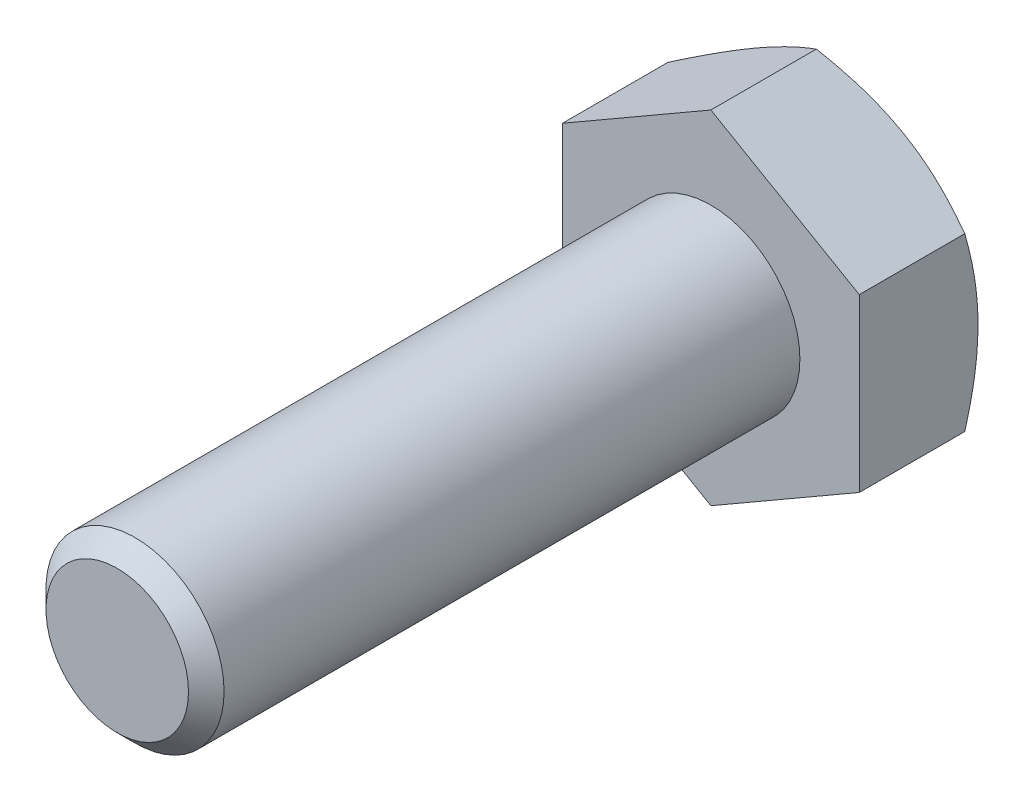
ISO-10303-21;
HEADER;
FILE_DESCRIPTION(('STEP AP214'),'2;1');
FILE_NAME('part.step','',(''),(''),'','','');
FILE_SCHEMA(('AUTOMOTIVE_DESIGN { 1 0 10303 214 1 1 1 1 }'));
ENDSEC;
DATA;
#1=APPLICATION_CONTEXT('core data for automotive mechanical design processes');
#2=APPLICATION_PROTOCOL_DEFINITION('international standard','automotive_design',2000,#1);
#3=PRODUCT_CONTEXT('',#1,'mechanical');
#4=PRODUCT('Part','Part','',(#3));
#5=PRODUCT_RELATED_PRODUCT_CATEGORY('part','',(#4));
#6=PRODUCT_DEFINITION_FORMATION('','',#4);
#7=PRODUCT_DEFINITION_CONTEXT('part definition',#1,'design');
#8=PRODUCT_DEFINITION('design','',#6,#7);
#9=PRODUCT_DEFINITION_SHAPE('','',#8);
#10=(LENGTH_UNIT() NAMED_UNIT(*) SI_UNIT(.MILLI.,.METRE.));
#11=(NAMED_UNIT(*) PLANE_ANGLE_UNIT() SI_UNIT($,.RADIAN.));
#12=(NAMED_UNIT(*) SI_UNIT($,.STERADIAN.) SOLID_ANGLE_UNIT());
#13=UNCERTAINTY_MEASURE_WITH_UNIT(LENGTH_MEASURE(1.E-05),#10,'distance_accuracy_value','');
#14=(GEOMETRIC_REPRESENTATION_CONTEXT(3) GLOBAL_UNCERTAINTY_ASSIGNED_CONTEXT((#13)) GLOBAL_UNIT_ASSIGNED_CONTEXT((#10,
#11,#12)) REPRESENTATION_CONTEXT('',''));
#15=CARTESIAN_POINT('',(0.,0.,0.));
#16=DIRECTION('',(0.,0.,1.));
#17=DIRECTION('',(1.,0.,0.));
#18=AXIS2_PLACEMENT_3D('',#15,#16,#17);
#19=CARTESIAN_POINT('',(0.,0.,20.));
#20=DIRECTION('',(0.,0.,1.));
#21=DIRECTION('',(1.,0.,0.));
#22=AXIS2_PLACEMENT_3D('',#19,#20,#21);
#23=PLANE('',#22);
#24=CARTESIAN_POINT('',(0.,0.,20.));
#25=DIRECTION('',(0.,0.,1.));
#26=DIRECTION('',(1.,0.,0.));
#27=AXIS2_PLACEMENT_3D('',#24,#25,#26);
#28=CIRCLE('',#27,2.4);
#29=CARTESIAN_POINT('',(2.40000000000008,0.,20.));
#30=VERTEX_POINT('',#29);
#31=EDGE_CURVE('E203',#30,#30,#28,.T.);
#32=ORIENTED_EDGE('',*,*,#31,.T.);
#33=EDGE_LOOP('',(#32));
#34=FACE_BOUND('',#33,.T.);
#35=ADVANCED_FACE('F29',(#34),#23,.T.);
#36=CARTESIAN_POINT('',(0.,0.,0.));
#37=DIRECTION('',(0.,0.,1.));
#38=DIRECTION('',(1.,0.,0.));
#39=AXIS2_PLACEMENT_3D('',#36,#37,#38);
#40=CYLINDRICAL_SURFACE('',#39,3.);
#41=CARTESIAN_POINT('',(0.,0.,19.4));
#42=DIRECTION('',(0.,0.,1.));
#43=DIRECTION('',(1.,0.,0.));
#44=AXIS2_PLACEMENT_3D('',#41,#42,#43);
#45=CIRCLE('',#44,3.);
#46=CARTESIAN_POINT('',(3.00000000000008,0.,19.4));
#47=VERTEX_POINT('',#46);
#48=EDGE_CURVE('E205',#47,#47,#45,.F.);
#49=ORIENTED_EDGE('',*,*,#48,.T.);
#50=EDGE_LOOP('',(#49));
#51=FACE_BOUND('',#50,.T.);
#52=CARTESIAN_POINT('',(0.,0.,0.));
#53=DIRECTION('',(0.,0.,1.));
#54=DIRECTION('',(1.,0.,0.));
#55=AXIS2_PLACEMENT_3D('',#52,#53,#54);
#56=CIRCLE('',#55,3.);
#57=CARTESIAN_POINT('',(3.00000000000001,0.,0.));
#58=VERTEX_POINT('',#57);
#59=EDGE_CURVE('E206',#58,#58,#56,.F.);
#60=ORIENTED_EDGE('',*,*,#59,.F.);
#61=EDGE_LOOP('',(#60));
#62=FACE_BOUND('',#61,.T.);
#63=ADVANCED_FACE('F194',(#51,#62),#40,.T.);
#64=CARTESIAN_POINT('',(0.,0.,20.));
#65=DIRECTION('',(0.,0.,-1.));
#66=DIRECTION('',(-1.,0.,0.));
#67=AXIS2_PLACEMENT_3D('',#64,#65,#66);
#68=CONICAL_SURFACE('',#67,2.4,0.785398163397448);
#69=ORIENTED_EDGE('',*,*,#48,.F.);
#70=EDGE_LOOP('',(#69));
#71=FACE_BOUND('',#70,.T.);
#72=ORIENTED_EDGE('',*,*,#31,.F.);
#73=EDGE_LOOP('',(#72));
#74=FACE_BOUND('',#73,.T.);
#75=ADVANCED_FACE('F199',(#71,#74),#68,.T.);
#76=CARTESIAN_POINT('',(0.,5.77350269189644,-3.99999999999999));
#77=DIRECTION('',(0.5,0.866025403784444,0.));
#78=DIRECTION('',(-0.866025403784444,0.5,0.));
#79=AXIS2_PLACEMENT_3D('',#76,#77,#78);
#80=PLANE('',#79);
#81=CARTESIAN_POINT('',(-0.000200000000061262,5.77361816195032,-3.55335134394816));
#82=CARTESIAN_POINT('',(0.219534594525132,5.64675433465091,-3.62661343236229));
#83=CARTESIAN_POINT('',(0.441148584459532,5.5188054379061,-3.6932486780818));
#84=CARTESIAN_POINT('',(0.888213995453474,5.26069210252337,-3.80956100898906));
#85=CARTESIAN_POINT('',(1.11367335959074,5.1305230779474,-3.8591969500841));
#86=CARTESIAN_POINT('',(1.56183230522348,4.8717783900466,-3.9364489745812));
#87=CARTESIAN_POINT('',(1.78446209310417,4.74324302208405,-3.96457962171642));
#88=CARTESIAN_POINT('',(2.11918990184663,4.54998783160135,-3.98980507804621));
#89=CARTESIAN_POINT('',(2.23084219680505,4.48552534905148,-3.9953865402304));
#90=CARTESIAN_POINT('',(2.45424997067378,4.35654081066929,-4.00079778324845));
#91=CARTESIAN_POINT('',(2.56600544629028,4.29201875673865,-4.00062774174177));
#92=CARTESIAN_POINT('',(2.87218423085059,4.11524635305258,-3.99224636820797));
#93=CARTESIAN_POINT('',(3.06650608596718,4.00305457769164,-3.97817022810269));
#94=CARTESIAN_POINT('',(3.45386010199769,3.77941563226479,-3.93353474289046));
#95=CARTESIAN_POINT('',(3.64689090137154,3.66796924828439,-3.90296013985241));
#96=CARTESIAN_POINT('',(4.03502534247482,3.44387972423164,-3.82653150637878));
#97=CARTESIAN_POINT('',(4.2300799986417,3.331264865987,-3.78035362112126));
#98=CARTESIAN_POINT('',(4.61728034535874,3.10771464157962,-3.67554820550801));
#99=CARTESIAN_POINT('',(4.80943099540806,2.99677641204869,-3.61694529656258));
#100=CARTESIAN_POINT('',(5.00019999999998,2.88663587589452,-3.55335134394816));
#101=B_SPLINE_CURVE_WITH_KNOTS('',3,(#81,#82,#83,#84,#85,#86,#87,#88,#89,#90,#91,#92,#93,#94,
#95,#96,#97,#98,#99,#100),.UNSPECIFIED.,.F.,.F.,(4,2,2,2,2,2,2,2,2,4),(0.,0.792555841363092,
1.58701660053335,2.36181537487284,2.74884076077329,3.13585419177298,3.80962362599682,
4.48401723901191,5.1733688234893,5.86136694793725),.UNSPECIFIED.);
#102=CARTESIAN_POINT('',(0.,5.77350269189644,-3.55341801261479));
#103=VERTEX_POINT('',#102);
#104=CARTESIAN_POINT('',(2.50000000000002,4.33012701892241,-3.99999999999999));
#105=VERTEX_POINT('',#104);
#106=EDGE_CURVE('E239',#103,#105,#101,.T.);
#107=ORIENTED_EDGE('',*,*,#106,.F.);
#108=DIRECTION('',(0.,0.,1.));
#109=VECTOR('',#108,1.);
#110=CARTESIAN_POINT('',(0.,5.77350269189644,-3.99999999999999));
#111=LINE('',#110,#109);
#112=CARTESIAN_POINT('',(0.,5.77350269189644,0.));
#113=VERTEX_POINT('',#112);
#114=EDGE_CURVE('E213',#103,#113,#111,.T.);
#115=ORIENTED_EDGE('',*,*,#114,.T.);
#116=DIRECTION('',(-0.866025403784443,0.5,0.));
#117=VECTOR('',#116,1.);
#118=CARTESIAN_POINT('',(0.,5.77350269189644,0.));
#119=LINE('',#118,#117);
#120=CARTESIAN_POINT('',(5.,2.88675134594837,0.));
#121=VERTEX_POINT('',#120);
#122=EDGE_CURVE('E237',#121,#113,#119,.T.);
#123=ORIENTED_EDGE('',*,*,#122,.F.);
#124=DIRECTION('',(0.,0.,1.));
#125=VECTOR('',#124,1.);
#126=CARTESIAN_POINT('',(5.00000000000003,2.88675134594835,-4.));
#127=LINE('',#126,#125);
#128=CARTESIAN_POINT('',(5.,2.88675134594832,-3.55341801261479));
#129=VERTEX_POINT('',#128);
#130=EDGE_CURVE('E210',#129,#121,#127,.T.);
#131=ORIENTED_EDGE('',*,*,#130,.F.);
#132=EDGE_CURVE('E169',#105,#129,#101,.T.);
#133=ORIENTED_EDGE('',*,*,#132,.F.);
#134=EDGE_LOOP('',(#107,#115,#123,#131,#133));
#135=FACE_BOUND('',#134,.T.);
#136=ADVANCED_FACE('F179',(#135),#80,.T.);
#137=CARTESIAN_POINT('',(5.00000000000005,-2.88675134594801,-4.));
#138=DIRECTION('',(1.,0.,0.));
#139=DIRECTION('',(0.,0.,-1.));
#140=AXIS2_PLACEMENT_3D('',#137,#138,#139);
#141=PLANE('',#140);
#142=CARTESIAN_POINT('',(5.00000000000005,-7.8736570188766,-1.5017575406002));
#143=CARTESIAN_POINT('',(5.00000000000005,-7.65421637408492,-1.60868091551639));
#144=CARTESIAN_POINT('',(5.00000000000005,-7.43428458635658,-1.71461296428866));
#145=CARTESIAN_POINT('',(5.00000000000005,-6.99317792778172,-1.92393906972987));
#146=CARTESIAN_POINT('',(5.00000000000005,-6.77200287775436,-2.02733274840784));
#147=CARTESIAN_POINT('',(5.00000000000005,-6.32706593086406,-2.23152152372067));
#148=CARTESIAN_POINT('',(5.00000000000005,-6.10329657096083,-2.33230041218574));
#149=CARTESIAN_POINT('',(5.00000000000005,-5.65401907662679,-2.52988978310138));
#150=CARTESIAN_POINT('',(5.00000000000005,-5.42851102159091,-2.62670044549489));
#151=CARTESIAN_POINT('',(5.00000000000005,-4.96773019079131,-2.81850105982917));
#152=CARTESIAN_POINT('',(5.00000000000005,-4.73238523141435,-2.91331851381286));
#153=CARTESIAN_POINT('',(5.00000000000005,-4.25898650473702,-3.096062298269));
#154=CARTESIAN_POINT('',(5.00000000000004,-4.02093244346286,-3.18398787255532));
#155=CARTESIAN_POINT('',(5.00000000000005,-3.54214478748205,-3.3507272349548));
#156=CARTESIAN_POINT('',(5.00000000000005,-3.3014173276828,-3.42955846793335));
#157=CARTESIAN_POINT('',(5.00000000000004,-2.81651125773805,-3.5756591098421));
#158=CARTESIAN_POINT('',(5.00000000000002,-2.57233372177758,-3.64293203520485));
#159=CARTESIAN_POINT('',(5.00000000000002,-2.08173956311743,-3.7624103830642));
#160=CARTESIAN_POINT('',(5.00000000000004,-1.8353438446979,-3.81470009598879));
#161=CARTESIAN_POINT('',(5.00000000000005,-1.3393671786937,-3.90133365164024));
#162=CARTESIAN_POINT('',(5.00000000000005,-1.08978658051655,-3.93567944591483));
#163=CARTESIAN_POINT('',(5.00000000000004,-0.591994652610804,-3.98324171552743));
#164=CARTESIAN_POINT('',(5.00000000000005,-0.343810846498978,-3.99673913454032));
#165=CARTESIAN_POINT('',(5.00000000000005,0.152820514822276,-4.00220795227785));
#166=CARTESIAN_POINT('',(5.00000000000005,0.401268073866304,-3.99417903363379));
#167=CARTESIAN_POINT('',(5.00000000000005,0.819539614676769,-3.96311999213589));
#168=CARTESIAN_POINT('',(5.00000000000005,0.989794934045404,-3.9455293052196));
#169=CARTESIAN_POINT('',(5.00000000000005,1.32912938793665,-3.90127081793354));
#170=CARTESIAN_POINT('',(5.00000000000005,1.49820837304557,-3.87460188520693));
#171=CARTESIAN_POINT('',(5.00000000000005,2.00341173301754,-3.78237229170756));
#172=CARTESIAN_POINT('',(5.00000000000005,2.33733597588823,-3.70460290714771));
#173=CARTESIAN_POINT('',(5.00000000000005,2.83691487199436,-3.56883106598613));
#174=CARTESIAN_POINT('',(5.00000000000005,3.00513229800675,-3.51971360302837));
#175=CARTESIAN_POINT('',(5.00000000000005,3.33993504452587,-3.41615110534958));
#176=CARTESIAN_POINT('',(5.00000000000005,3.50652035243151,-3.36170602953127));
#177=CARTESIAN_POINT('',(5.00000000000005,3.83810926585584,-3.24838071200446));
#178=CARTESIAN_POINT('',(5.00000000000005,4.00311330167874,-3.18950171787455));
#179=CARTESIAN_POINT('',(5.00000000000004,4.33173746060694,-3.06802383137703));
#180=CARTESIAN_POINT('',(5.00000000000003,4.49535761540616,-3.00542502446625));
#181=CARTESIAN_POINT('',(5.00000000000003,4.93598294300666,-2.8320195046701));
#182=CARTESIAN_POINT('',(5.00000000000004,5.21182602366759,-2.71826266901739));
#183=CARTESIAN_POINT('',(5.00000000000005,5.76066658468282,-2.48405585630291));
#184=CARTESIAN_POINT('',(5.00000000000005,6.03366374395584,-2.36360513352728));
#185=CARTESIAN_POINT('',(5.00000000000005,6.57746623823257,-2.11759609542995));
#186=CARTESIAN_POINT('',(5.00000000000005,6.84827068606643,-1.99203582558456));
#187=CARTESIAN_POINT('',(5.00000000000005,7.38802449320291,-1.73703058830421));
#188=CARTESIAN_POINT('',(5.00000000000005,7.65697392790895,-1.6075857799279));
#189=CARTESIAN_POINT('',(5.00000000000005,8.19381940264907,-1.34544789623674));
#190=CARTESIAN_POINT('',(5.00000000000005,8.46171304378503,-1.21274991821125));
#191=CARTESIAN_POINT('',(5.00000000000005,8.99628800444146,-0.944933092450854));
#192=CARTESIAN_POINT('',(5.00000000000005,9.2629693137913,-0.809814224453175));
#193=CARTESIAN_POINT('',(5.00000000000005,10.0614145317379,-0.401627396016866));
#194=CARTESIAN_POINT('',(5.00000000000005,10.5917004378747,-0.125669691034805));
#195=CARTESIAN_POINT('',(5.00000000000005,11.5934978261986,0.40186932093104));
#196=CARTESIAN_POINT('',(5.00000000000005,12.0652823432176,0.652934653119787));
#197=CARTESIAN_POINT('',(5.00000000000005,13.0072652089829,1.15809174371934));
#198=CARTESIAN_POINT('',(5.00000000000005,13.4774634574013,1.4121836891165));
#199=CARTESIAN_POINT('',(5.00000000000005,14.4150598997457,1.92174727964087));
#200=CARTESIAN_POINT('',(5.00000000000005,14.8824621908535,2.17721139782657));
#201=CARTESIAN_POINT('',(5.00000000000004,15.8162766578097,2.68985606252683));
#202=CARTESIAN_POINT('',(5.00000000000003,16.2826889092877,2.94703647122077));
#203=CARTESIAN_POINT('',(5.,16.7487534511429,3.20484156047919));
#204=B_SPLINE_CURVE_WITH_KNOTS('',3,(#142,#143,#144,#145,#146,#147,#148,#149,#150,#151,#152,
#153,#154,#155,#156,#157,#158,#159,#160,#161,#162,#163,#164,#165,#166,#167,#168,#169,#170,#171,
#172,#173,#174,#175,#176,#177,#178,#179,#180,#181,#182,#183,#184,#185,#186,#187,#188,#189,#190,
#191,#192,#193,#194,#195,#196,#197,#198,#199,#200,#201,#202,#203),.UNSPECIFIED.,.F.,.F.,(4,2,2,
2,2,2,2,2,2,2,2,2,2,2,2,2,2,2,2,2,2,2,2,2,2,2,2,2,2,2,4),(0.,0.732320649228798,1.46474969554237,
2.2009673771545,2.93715163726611,3.69825037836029,4.45943251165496,5.21912936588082,
5.97859468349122,6.73369963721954,7.48872245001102,8.23347928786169,8.97824710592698,
9.49148539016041,10.0047877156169,11.0318914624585,11.5575684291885,12.083249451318,
12.6087831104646,13.1343047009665,14.0293094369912,14.9244140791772,15.8198643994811,
16.7152781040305,17.6121361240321,18.5090016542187,20.3023290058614,21.9056050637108,
23.5089806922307,25.1069572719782,26.7048070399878),.UNSPECIFIED.);
#205=CARTESIAN_POINT('',(5.00000000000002,2.22044604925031E-13,-4.));
#206=VERTEX_POINT('',#205);
#207=EDGE_CURVE('E167',#129,#206,#204,.F.);
#208=ORIENTED_EDGE('',*,*,#207,.F.);
#209=ORIENTED_EDGE('',*,*,#130,.T.);
#210=DIRECTION('',(0.,1.,0.));
#211=VECTOR('',#210,1.);
#212=CARTESIAN_POINT('',(5.00000000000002,-2.88675134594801,0.));
#213=LINE('',#212,#211);
#214=CARTESIAN_POINT('',(5.00000000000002,-2.88675134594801,0.));
#215=VERTEX_POINT('',#214);
#216=EDGE_CURVE('E215',#215,#121,#213,.T.);
#217=ORIENTED_EDGE('',*,*,#216,.F.);
#218=DIRECTION('',(0.,0.,1.));
#219=VECTOR('',#218,1.);
#220=CARTESIAN_POINT('',(5.00000000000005,-2.88675134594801,-4.));
#221=LINE('',#220,#219);
#222=CARTESIAN_POINT('',(5.00000000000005,-2.88675134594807,-3.55341801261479));
#223=VERTEX_POINT('',#222);
#224=EDGE_CURVE('E221',#223,#215,#221,.T.);
#225=ORIENTED_EDGE('',*,*,#224,.F.);
#226=EDGE_CURVE('E162',#206,#223,#204,.F.);
#227=ORIENTED_EDGE('',*,*,#226,.F.);
#228=EDGE_LOOP('',(#208,#209,#217,#225,#227));
#229=FACE_BOUND('',#228,.T.);
#230=ADVANCED_FACE('F175',(#229),#141,.T.);
#231=CARTESIAN_POINT('',(0.,-5.77350269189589,-4.));
#232=DIRECTION('',(0.5,-0.866025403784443,0.));
#233=DIRECTION('',(0.866025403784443,0.5,0.));
#234=AXIS2_PLACEMENT_3D('',#231,#232,#233);
#235=PLANE('',#234);
#236=CARTESIAN_POINT('',(5.00020000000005,-2.88663587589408,-3.55335134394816));
#237=CARTESIAN_POINT('',(4.78046540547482,-3.01349970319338,-3.62661343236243));
#238=CARTESIAN_POINT('',(4.5588514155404,-3.14144859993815,-3.69324867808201));
#239=CARTESIAN_POINT('',(4.11178600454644,-3.39956193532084,-3.80956100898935));
#240=CARTESIAN_POINT('',(3.88632664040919,-3.52973095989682,-3.85919695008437));
#241=CARTESIAN_POINT('',(3.43816769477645,-3.78847564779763,-3.93644897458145));
#242=CARTESIAN_POINT('',(3.21553790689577,-3.91701101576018,-3.96457962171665));
#243=CARTESIAN_POINT('',(2.8808100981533,-4.11026620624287,-3.98980507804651));
#244=CARTESIAN_POINT('',(2.76915780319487,-4.17472868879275,-3.99538654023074));
#245=CARTESIAN_POINT('',(2.54575002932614,-4.30371322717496,-4.00079778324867));
#246=CARTESIAN_POINT('',(2.43399455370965,-4.36823528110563,-4.00062774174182));
#247=CARTESIAN_POINT('',(2.12781576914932,-4.54500768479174,-3.99224636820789));
#248=CARTESIAN_POINT('',(1.93349391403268,-4.65719946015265,-3.97817022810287));
#249=CARTESIAN_POINT('',(1.54613989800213,-4.88083840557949,-3.93353474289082));
#250=CARTESIAN_POINT('',(1.35310909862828,-4.99228478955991,-3.90296013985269));
#251=CARTESIAN_POINT('',(0.964974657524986,-5.21637431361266,-3.826531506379));
#252=CARTESIAN_POINT('',(0.769920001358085,-5.32898917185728,-3.7803536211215));
#253=CARTESIAN_POINT('',(0.382719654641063,-5.55253939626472,-3.67554820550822));
#254=CARTESIAN_POINT('',(0.190569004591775,-5.66347762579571,-3.61694529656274));
#255=CARTESIAN_POINT('',(-0.000200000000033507,-5.77361816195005,-3.55335134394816));
#256=B_SPLINE_CURVE_WITH_KNOTS('',3,(#236,#237,#238,#239,#240,#241,#242,#243,#244,#245,#246,
#247,#248,#249,#250,#251,#252,#253,#254,#255),.UNSPECIFIED.,.F.,.F.,(4,2,2,2,2,2,2,2,2,4),(0.,
0.792555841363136,1.58701660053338,2.36181537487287,2.74884076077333,3.13585419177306,
3.80962362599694,4.48401723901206,5.17336882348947,5.86136694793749),.UNSPECIFIED.);
#257=CARTESIAN_POINT('',(2.49999999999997,-4.3301270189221,-3.99999999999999));
#258=VERTEX_POINT('',#257);
#259=EDGE_CURVE('E168',#223,#258,#256,.T.);
#260=ORIENTED_EDGE('',*,*,#259,.F.);
#261=ORIENTED_EDGE('',*,*,#224,.T.);
#262=DIRECTION('',(0.866025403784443,0.5,0.));
#263=VECTOR('',#262,1.);
#264=CARTESIAN_POINT('',(0.,-5.77350269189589,0.));
#265=LINE('',#264,#263);
#266=CARTESIAN_POINT('',(0.,-5.77350269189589,0.));
#267=VERTEX_POINT('',#266);
#268=EDGE_CURVE('E226',#267,#215,#265,.T.);
#269=ORIENTED_EDGE('',*,*,#268,.F.);
#270=DIRECTION('',(0.,0.,1.));
#271=VECTOR('',#270,1.);
#272=CARTESIAN_POINT('',(0.,-5.77350269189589,-4.));
#273=LINE('',#272,#271);
#274=CARTESIAN_POINT('',(0.,-5.77350269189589,-3.55341801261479));
#275=VERTEX_POINT('',#274);
#276=EDGE_CURVE('E219',#275,#267,#273,.T.);
#277=ORIENTED_EDGE('',*,*,#276,.F.);
#278=EDGE_CURVE('E156',#258,#275,#256,.T.);
#279=ORIENTED_EDGE('',*,*,#278,.F.);
#280=EDGE_LOOP('',(#260,#261,#269,#277,#279));
#281=FACE_BOUND('',#280,.T.);
#282=ADVANCED_FACE('F178',(#281),#235,.T.);
#283=CARTESIAN_POINT('',(0.,-5.77350269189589,-4.));
#284=DIRECTION('',(-0.500000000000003,-0.866025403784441,0.));
#285=DIRECTION('',(0.866025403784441,-0.500000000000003,0.));
#286=AXIS2_PLACEMENT_3D('',#283,#284,#285);
#287=PLANE('',#286);
#288=CARTESIAN_POINT('',(0.000200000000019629,-5.77361816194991,-3.55335134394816));
#289=CARTESIAN_POINT('',(-0.219534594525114,-5.64675433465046,-3.62661343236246));
#290=CARTESIAN_POINT('',(-0.441148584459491,-5.51880543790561,-3.69324867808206));
#291=CARTESIAN_POINT('',(-0.888213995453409,-5.26069210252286,-3.80956100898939));
#292=CARTESIAN_POINT('',(-1.11367335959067,-5.1305230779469,-3.8591969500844));
#293=CARTESIAN_POINT('',(-1.56183230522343,-4.87177839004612,-3.93644897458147));
#294=CARTESIAN_POINT('',(-1.78446209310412,-4.74324302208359,-3.96457962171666));
#295=CARTESIAN_POINT('',(-2.11918990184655,-4.54998783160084,-3.98980507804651));
#296=CARTESIAN_POINT('',(-2.23084219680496,-4.48552534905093,-3.99538654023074));
#297=CARTESIAN_POINT('',(-2.45424997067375,-4.35654081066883,-4.00079778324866));
#298=CARTESIAN_POINT('',(-2.56600544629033,-4.29201875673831,-4.00062774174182));
#299=CARTESIAN_POINT('',(-2.87218423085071,-4.11524635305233,-3.99224636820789));
#300=CARTESIAN_POINT('',(-3.0665060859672,-4.00305457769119,-3.97817022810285));
#301=CARTESIAN_POINT('',(-3.45386010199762,-3.77941563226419,-3.93353474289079));
#302=CARTESIAN_POINT('',(-3.6468909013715,-3.66796924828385,-3.90296013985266));
#303=CARTESIAN_POINT('',(-4.03502534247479,-3.44387972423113,-3.82653150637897));
#304=CARTESIAN_POINT('',(-4.23007999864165,-3.33126486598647,-3.78035362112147));
#305=CARTESIAN_POINT('',(-4.61728034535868,-3.10771464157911,-3.6755482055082));
#306=CARTESIAN_POINT('',(-4.80943099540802,-2.99677641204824,-3.61694529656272));
#307=CARTESIAN_POINT('',(-5.00020000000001,-2.88663587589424,-3.55335134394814));
#308=B_SPLINE_CURVE_WITH_KNOTS('',3,(#288,#289,#290,#291,#292,#293,#294,#295,#296,#297,#298,
#299,#300,#301,#302,#303,#304,#305,#306,#307),.UNSPECIFIED.,.F.,.F.,(4,2,2,2,2,2,2,2,2,4),(0.,
0.792555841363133,1.58701660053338,2.36181537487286,2.74884076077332,3.13585419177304,
3.80962362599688,4.48401723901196,5.17336882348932,5.86136694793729),.UNSPECIFIED.);
#309=CARTESIAN_POINT('',(-2.50000000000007,-4.33012701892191,-4.00000000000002));
#310=VERTEX_POINT('',#309);
#311=EDGE_CURVE('E258',#275,#310,#308,.T.);
#312=ORIENTED_EDGE('',*,*,#311,.F.);
#313=ORIENTED_EDGE('',*,*,#276,.T.);
#314=DIRECTION('',(0.866025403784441,-0.500000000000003,0.));
#315=VECTOR('',#314,1.);
#316=CARTESIAN_POINT('',(0.,-5.77350269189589,0.));
#317=LINE('',#316,#315);
#318=CARTESIAN_POINT('',(-5.00000000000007,-2.88675134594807,0.));
#319=VERTEX_POINT('',#318);
#320=EDGE_CURVE('E229',#319,#267,#317,.T.);
#321=ORIENTED_EDGE('',*,*,#320,.F.);
#322=DIRECTION('',(0.,0.,1.));
#323=VECTOR('',#322,1.);
#324=CARTESIAN_POINT('',(-5.00000000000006,-2.88675134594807,-3.99999999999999));
#325=LINE('',#324,#323);
#326=CARTESIAN_POINT('',(-5.00000000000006,-2.88675134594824,-3.55341801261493));
#327=VERTEX_POINT('',#326);
#328=EDGE_CURVE('E217',#327,#319,#325,.T.);
#329=ORIENTED_EDGE('',*,*,#328,.F.);
#330=EDGE_CURVE('E105',#310,#327,#308,.T.);
#331=ORIENTED_EDGE('',*,*,#330,.F.);
#332=EDGE_LOOP('',(#312,#313,#321,#329,#331));
#333=FACE_BOUND('',#332,.T.);
#334=ADVANCED_FACE('F183',(#333),#287,.T.);
#335=CARTESIAN_POINT('',(-5.00000000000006,-2.88675134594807,-3.99999999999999));
#336=DIRECTION('',(-1.,0.,0.));
#337=DIRECTION('',(0.,0.,1.));
#338=AXIS2_PLACEMENT_3D('',#335,#336,#337);
#339=PLANE('',#338);
#340=CARTESIAN_POINT('',(-4.99999999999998,-7.8736570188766,-1.50175754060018));
#341=CARTESIAN_POINT('',(-5.00000000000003,-7.65421637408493,-1.60868091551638));
#342=CARTESIAN_POINT('',(-5.00000000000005,-7.43428458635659,-1.71461296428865));
#343=CARTESIAN_POINT('',(-5.00000000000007,-6.99317792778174,-1.92393906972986));
#344=CARTESIAN_POINT('',(-5.00000000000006,-6.77200287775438,-2.02733274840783));
#345=CARTESIAN_POINT('',(-5.00000000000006,-6.32706593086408,-2.23152152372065));
#346=CARTESIAN_POINT('',(-5.00000000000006,-6.10329657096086,-2.33230041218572));
#347=CARTESIAN_POINT('',(-5.00000000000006,-5.65401907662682,-2.52988978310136));
#348=CARTESIAN_POINT('',(-5.00000000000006,-5.42851102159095,-2.62670044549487));
#349=CARTESIAN_POINT('',(-5.00000000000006,-4.96773019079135,-2.81850105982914));
#350=CARTESIAN_POINT('',(-5.00000000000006,-4.7323852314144,-2.91331851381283));
#351=CARTESIAN_POINT('',(-5.00000000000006,-4.25898650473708,-3.09606229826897));
#352=CARTESIAN_POINT('',(-5.00000000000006,-4.02093244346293,-3.18398787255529));
#353=CARTESIAN_POINT('',(-5.00000000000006,-3.54214478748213,-3.35072723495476));
#354=CARTESIAN_POINT('',(-5.00000000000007,-3.30141732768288,-3.42955846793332));
#355=CARTESIAN_POINT('',(-5.00000000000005,-2.81651125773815,-3.57565910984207));
#356=CARTESIAN_POINT('',(-5.00000000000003,-2.57233372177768,-3.64293203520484));
#357=CARTESIAN_POINT('',(-5.00000000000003,-2.08173956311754,-3.76241038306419));
#358=CARTESIAN_POINT('',(-5.00000000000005,-1.835343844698,-3.81470009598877));
#359=CARTESIAN_POINT('',(-5.00000000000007,-1.3393671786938,-3.90133365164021));
#360=CARTESIAN_POINT('',(-5.00000000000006,-1.08978658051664,-3.93567944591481));
#361=CARTESIAN_POINT('',(-5.00000000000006,-0.591994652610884,-3.98324171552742));
#362=CARTESIAN_POINT('',(-5.00000000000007,-0.343810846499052,-3.99673913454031));
#363=CARTESIAN_POINT('',(-5.00000000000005,0.152820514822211,-4.00220795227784));
#364=CARTESIAN_POINT('',(-5.00000000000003,0.401268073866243,-3.99417903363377));
#365=CARTESIAN_POINT('',(-5.00000000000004,0.819539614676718,-3.96311999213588));
#366=CARTESIAN_POINT('',(-5.00000000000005,0.989794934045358,-3.94552930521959));
#367=CARTESIAN_POINT('',(-5.00000000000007,1.32912938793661,-3.90127081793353));
#368=CARTESIAN_POINT('',(-5.00000000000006,1.49820837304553,-3.87460188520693));
#369=CARTESIAN_POINT('',(-5.00000000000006,2.00341173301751,-3.78237229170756));
#370=CARTESIAN_POINT('',(-5.00000000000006,2.33733597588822,-3.70460290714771));
#371=CARTESIAN_POINT('',(-5.00000000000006,2.83691487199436,-3.56883106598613));
#372=CARTESIAN_POINT('',(-5.00000000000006,3.00513229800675,-3.51971360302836));
#373=CARTESIAN_POINT('',(-5.00000000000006,3.33993504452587,-3.41615110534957));
#374=CARTESIAN_POINT('',(-5.00000000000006,3.50652035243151,-3.36170602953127));
#375=CARTESIAN_POINT('',(-5.00000000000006,3.83810926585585,-3.24838071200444));
#376=CARTESIAN_POINT('',(-5.00000000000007,4.00311330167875,-3.18950171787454));
#377=CARTESIAN_POINT('',(-5.00000000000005,4.33173746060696,-3.06802383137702));
#378=CARTESIAN_POINT('',(-5.00000000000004,4.49535761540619,-3.00542502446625));
#379=CARTESIAN_POINT('',(-5.00000000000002,4.93598294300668,-2.83201950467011));
#380=CARTESIAN_POINT('',(-5.00000000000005,5.21182602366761,-2.71826266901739));
#381=CARTESIAN_POINT('',(-5.00000000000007,5.76066658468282,-2.48405585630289));
#382=CARTESIAN_POINT('',(-5.00000000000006,6.03366374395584,-2.36360513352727));
#383=CARTESIAN_POINT('',(-5.00000000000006,6.57746623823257,-2.11759609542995));
#384=CARTESIAN_POINT('',(-5.00000000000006,6.84827068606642,-1.99203582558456));
#385=CARTESIAN_POINT('',(-5.00000000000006,7.3880244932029,-1.73703058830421));
#386=CARTESIAN_POINT('',(-5.00000000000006,7.65697392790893,-1.60758577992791));
#387=CARTESIAN_POINT('',(-5.00000000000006,8.19381940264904,-1.34544789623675));
#388=CARTESIAN_POINT('',(-5.00000000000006,8.461713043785,-1.21274991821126));
#389=CARTESIAN_POINT('',(-5.00000000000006,8.99628800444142,-0.944933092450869));
#390=CARTESIAN_POINT('',(-5.00000000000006,9.26296931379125,-0.809814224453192));
#391=CARTESIAN_POINT('',(-5.00000000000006,10.0614145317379,-0.40162739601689));
#392=CARTESIAN_POINT('',(-5.00000000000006,10.5917004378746,-0.125669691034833));
#393=CARTESIAN_POINT('',(-5.00000000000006,11.5934978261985,0.401869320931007));
#394=CARTESIAN_POINT('',(-5.00000000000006,12.0652823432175,0.652934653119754));
#395=CARTESIAN_POINT('',(-5.00000000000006,13.0072652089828,1.1580917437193));
#396=CARTESIAN_POINT('',(-5.00000000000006,13.4774634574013,1.41218368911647));
#397=CARTESIAN_POINT('',(-5.00000000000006,14.4150598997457,1.92174727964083));
#398=CARTESIAN_POINT('',(-5.00000000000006,14.8824621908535,2.17721139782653));
#399=CARTESIAN_POINT('',(-5.00000000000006,15.8162766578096,2.6898560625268));
#400=CARTESIAN_POINT('',(-5.00000000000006,16.2826889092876,2.94703647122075));
#401=CARTESIAN_POINT('',(-5.00000000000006,16.7487534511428,3.2048415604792));
#402=B_SPLINE_CURVE_WITH_KNOTS('',3,(#340,#341,#342,#343,#344,#345,#346,#347,#348,#349,#350,
#351,#352,#353,#354,#355,#356,#357,#358,#359,#360,#361,#362,#363,#364,#365,#366,#367,#368,#369,
#370,#371,#372,#373,#374,#375,#376,#377,#378,#379,#380,#381,#382,#383,#384,#385,#386,#387,#388,
#389,#390,#391,#392,#393,#394,#395,#396,#397,#398,#399,#400,#401),.UNSPECIFIED.,.F.,.F.,(4,2,2,
2,2,2,2,2,2,2,2,2,2,2,2,2,2,2,2,2,2,2,2,2,2,2,2,2,2,2,4),(0.,0.732320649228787,1.46474969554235,
2.20096737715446,2.93715163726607,3.69825037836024,4.45943251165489,5.21912936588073,
5.97859468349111,6.73369963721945,7.48872245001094,8.23347928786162,8.97824710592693,
9.49148539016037,10.0047877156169,11.0318914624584,11.5575684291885,12.083249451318,
12.6087831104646,13.1343047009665,14.0293094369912,14.9244140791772,15.8198643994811,
16.7152781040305,17.6121361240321,18.5090016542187,20.3023290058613,21.9056050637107,
23.5089806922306,25.1069572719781,26.7048070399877),.UNSPECIFIED.);
#403=CARTESIAN_POINT('',(-5.,1.38777878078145E-13,-3.99999999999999));
#404=VERTEX_POINT('',#403);
#405=EDGE_CURVE('E100',#327,#404,#402,.T.);
#406=ORIENTED_EDGE('',*,*,#405,.F.);
#407=ORIENTED_EDGE('',*,*,#328,.T.);
#408=DIRECTION('',(0.,-1.,0.));
#409=VECTOR('',#408,1.);
#410=CARTESIAN_POINT('',(-5.00000000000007,-2.88675134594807,0.));
#411=LINE('',#410,#409);
#412=CARTESIAN_POINT('',(-5.00000000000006,2.88675134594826,0.));
#413=VERTEX_POINT('',#412);
#414=EDGE_CURVE('E232',#413,#319,#411,.T.);
#415=ORIENTED_EDGE('',*,*,#414,.F.);
#416=DIRECTION('',(0.,0.,1.));
#417=VECTOR('',#416,1.);
#418=CARTESIAN_POINT('',(-5.00000000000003,2.88675134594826,-3.99999999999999));
#419=LINE('',#418,#417);
#420=CARTESIAN_POINT('',(-5.00000000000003,2.88675134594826,-3.55341801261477));
#421=VERTEX_POINT('',#420);
#422=EDGE_CURVE('E126',#421,#413,#419,.T.);
#423=ORIENTED_EDGE('',*,*,#422,.F.);
#424=EDGE_CURVE('E109',#404,#421,#402,.T.);
#425=ORIENTED_EDGE('',*,*,#424,.F.);
#426=EDGE_LOOP('',(#406,#407,#415,#423,#425));
#427=FACE_BOUND('',#426,.T.);
#428=ADVANCED_FACE('F124',(#427),#339,.T.);
#429=CARTESIAN_POINT('',(-5.00000000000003,2.88675134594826,-3.99999999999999));
#430=DIRECTION('',(-0.500000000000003,0.866025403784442,0.));
#431=DIRECTION('',(-0.866025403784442,-0.500000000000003,0.));
#432=AXIS2_PLACEMENT_3D('',#429,#430,#431);
#433=PLANE('',#432);
#434=CARTESIAN_POINT('',(-5.00019999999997,2.88663587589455,-3.55335134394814));
#435=CARTESIAN_POINT('',(-4.78046540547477,3.01349970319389,-3.62661343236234));
#436=CARTESIAN_POINT('',(-4.55885141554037,3.14144859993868,-3.69324867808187));
#437=CARTESIAN_POINT('',(-4.11178600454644,3.39956193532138,-3.80956100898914));
#438=CARTESIAN_POINT('',(-3.88632664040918,3.52973095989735,-3.85919695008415));
#439=CARTESIAN_POINT('',(-3.43816769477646,3.78847564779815,-3.93644897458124));
#440=CARTESIAN_POINT('',(-3.21553790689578,3.91701101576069,-3.96457962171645));
#441=CARTESIAN_POINT('',(-2.88081009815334,4.11026620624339,-3.98980507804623));
#442=CARTESIAN_POINT('',(-2.76915780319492,4.17472868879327,-3.99538654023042));
#443=CARTESIAN_POINT('',(-2.5457500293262,4.30371322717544,-4.00079778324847));
#444=CARTESIAN_POINT('',(-2.4339945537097,4.36823528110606,-4.00062774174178));
#445=CARTESIAN_POINT('',(-2.12781576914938,4.54500768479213,-3.99224636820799));
#446=CARTESIAN_POINT('',(-1.9334939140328,4.65719946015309,-3.97817022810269));
#447=CARTESIAN_POINT('',(-1.5461398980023,4.88083840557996,-3.93353474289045));
#448=CARTESIAN_POINT('',(-1.35310909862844,4.99228478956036,-3.90296013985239));
#449=CARTESIAN_POINT('',(-0.964974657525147,5.21637431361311,-3.82653150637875));
#450=CARTESIAN_POINT('',(-0.76992000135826,5.32898917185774,-3.78035362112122));
#451=CARTESIAN_POINT('',(-0.382719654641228,5.55253939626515,-3.67554820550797));
#452=CARTESIAN_POINT('',(-0.190569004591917,5.66347762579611,-3.61694529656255));
#453=CARTESIAN_POINT('',(0.000199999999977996,5.77361816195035,-3.55335134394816));
#454=B_SPLINE_CURVE_WITH_KNOTS('',3,(#434,#435,#436,#437,#438,#439,#440,#441,#442,#443,#444,
#445,#446,#447,#448,#449,#450,#451,#452,#453),.UNSPECIFIED.,.F.,.F.,(4,2,2,2,2,2,2,2,2,4),(0.,
0.792555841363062,1.58701660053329,2.36181537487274,2.74884076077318,3.13585419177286,
3.8096236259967,4.48401723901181,5.17336882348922,5.86136694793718),.UNSPECIFIED.);
#455=CARTESIAN_POINT('',(-2.50000000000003,4.33012701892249,-4.));
#456=VERTEX_POINT('',#455);
#457=EDGE_CURVE('E115',#421,#456,#454,.T.);
#458=ORIENTED_EDGE('',*,*,#457,.F.);
#459=ORIENTED_EDGE('',*,*,#422,.T.);
#460=DIRECTION('',(-0.866025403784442,-0.500000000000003,0.));
#461=VECTOR('',#460,1.);
#462=CARTESIAN_POINT('',(-5.00000000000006,2.88675134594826,0.));
#463=LINE('',#462,#461);
#464=EDGE_CURVE('E235',#113,#413,#463,.T.);
#465=ORIENTED_EDGE('',*,*,#464,.F.);
#466=ORIENTED_EDGE('',*,*,#114,.F.);
#467=EDGE_CURVE('E117',#456,#103,#454,.T.);
#468=ORIENTED_EDGE('',*,*,#467,.F.);
#469=EDGE_LOOP('',(#458,#459,#465,#466,#468));
#470=FACE_BOUND('',#469,.T.);
#471=ADVANCED_FACE('F191',(#470),#433,.T.);
#472=CARTESIAN_POINT('',(5.,2.88675134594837,0.));
#473=DIRECTION('',(0.,0.,1.));
#474=DIRECTION('',(1.,0.,0.));
#475=AXIS2_PLACEMENT_3D('',#472,#473,#474);
#476=PLANE('',#475);
#477=ORIENTED_EDGE('',*,*,#59,.T.);
#478=EDGE_LOOP('',(#477));
#479=FACE_BOUND('',#478,.T.);
#480=ORIENTED_EDGE('',*,*,#122,.T.);
#481=ORIENTED_EDGE('',*,*,#464,.T.);
#482=ORIENTED_EDGE('',*,*,#414,.T.);
#483=ORIENTED_EDGE('',*,*,#320,.T.);
#484=ORIENTED_EDGE('',*,*,#268,.T.);
#485=ORIENTED_EDGE('',*,*,#216,.T.);
#486=EDGE_LOOP('',(#480,#481,#482,#483,#484,#485));
#487=FACE_BOUND('',#486,.T.);
#488=ADVANCED_FACE('F148',(#479,#487),#476,.T.);
#489=CARTESIAN_POINT('',(0.,0.,0.));
#490=DIRECTION('',(0.,0.,1.));
#491=DIRECTION('',(1.,0.,0.));
#492=AXIS2_PLACEMENT_3D('',#489,#490,#491);
#493=CONICAL_SURFACE('',#492,11.9282032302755,1.0471975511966);
#494=ORIENTED_EDGE('',*,*,#132,.T.);
#495=ORIENTED_EDGE('',*,*,#207,.T.);
#496=CARTESIAN_POINT('',(0.,0.,-4.));
#497=DIRECTION('',(0.,0.,1.));
#498=DIRECTION('',(1.,0.,0.));
#499=AXIS2_PLACEMENT_3D('',#496,#497,#498);
#500=CIRCLE('',#499,5.);
#501=EDGE_CURVE('E32',#105,#206,#500,.F.);
#502=ORIENTED_EDGE('',*,*,#501,.F.);
#503=EDGE_LOOP('',(#494,#495,#502));
#504=FACE_BOUND('',#503,.T.);
#505=ADVANCED_FACE('F248',(#504),#493,.T.);
#506=ORIENTED_EDGE('',*,*,#106,.T.);
#507=EDGE_CURVE('E122',#456,#105,#500,.F.);
#508=ORIENTED_EDGE('',*,*,#507,.F.);
#509=ORIENTED_EDGE('',*,*,#467,.T.);
#510=EDGE_LOOP('',(#506,#508,#509));
#511=FACE_BOUND('',#510,.T.);
#512=ADVANCED_FACE('F147',(#511),#493,.T.);
#513=ORIENTED_EDGE('',*,*,#424,.T.);
#514=ORIENTED_EDGE('',*,*,#457,.T.);
#515=CARTESIAN_POINT('',(0.,0.,-4.));
#516=DIRECTION('',(0.,0.,-1.));
#517=DIRECTION('',(-1.,0.,0.));
#518=AXIS2_PLACEMENT_3D('',#515,#516,#517);
#519=CIRCLE('',#518,5.);
#520=EDGE_CURVE('E50',#404,#456,#519,.T.);
#521=ORIENTED_EDGE('',*,*,#520,.F.);
#522=EDGE_LOOP('',(#513,#514,#521));
#523=FACE_BOUND('',#522,.T.);
#524=ADVANCED_FACE('F113',(#523),#493,.T.);
#525=ORIENTED_EDGE('',*,*,#330,.T.);
#526=ORIENTED_EDGE('',*,*,#405,.T.);
#527=EDGE_CURVE('E102',#310,#404,#500,.F.);
#528=ORIENTED_EDGE('',*,*,#527,.F.);
#529=EDGE_LOOP('',(#525,#526,#528));
#530=FACE_BOUND('',#529,.T.);
#531=ADVANCED_FACE('F101',(#530),#493,.T.);
#532=ORIENTED_EDGE('',*,*,#278,.T.);
#533=ORIENTED_EDGE('',*,*,#311,.T.);
#534=EDGE_CURVE('E37',#258,#310,#500,.F.);
#535=ORIENTED_EDGE('',*,*,#534,.F.);
#536=EDGE_LOOP('',(#532,#533,#535));
#537=FACE_BOUND('',#536,.T.);
#538=ADVANCED_FACE('F260',(#537),#493,.T.);
#539=ORIENTED_EDGE('',*,*,#226,.T.);
#540=ORIENTED_EDGE('',*,*,#259,.T.);
#541=EDGE_CURVE('E11',#206,#258,#500,.F.);
#542=ORIENTED_EDGE('',*,*,#541,.F.);
#543=EDGE_LOOP('',(#539,#540,#542));
#544=FACE_BOUND('',#543,.T.);
#545=ADVANCED_FACE('F255',(#544),#493,.T.);
#546=CARTESIAN_POINT('',(5.00000000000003,2.88675134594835,-4.));
#547=DIRECTION('',(0.,0.,1.));
#548=DIRECTION('',(1.,0.,0.));
#549=AXIS2_PLACEMENT_3D('',#546,#547,#548);
#550=PLANE('',#549);
#551=ORIENTED_EDGE('',*,*,#501,.T.);
#552=ORIENTED_EDGE('',*,*,#541,.T.);
#553=ORIENTED_EDGE('',*,*,#534,.T.);
#554=ORIENTED_EDGE('',*,*,#527,.T.);
#555=ORIENTED_EDGE('',*,*,#520,.T.);
#556=ORIENTED_EDGE('',*,*,#507,.T.);
#557=EDGE_LOOP('',(#551,#552,#553,#554,#555,#556));
#558=FACE_BOUND('',#557,.T.);
#559=ADVANCED_FACE('F120',(#558),#550,.F.);
#560=CLOSED_SHELL('',(#35,#63,#75,#136,#230,#282,#334,#428,#471,#488,#505,#512,#524,#531,#538,
#545,#559));
#561=MANIFOLD_SOLID_BREP('B2',#560);
#562=ADVANCED_BREP_SHAPE_REPRESENTATION('',(#18,#561),#14);
#563=SHAPE_DEFINITION_REPRESENTATION(#9,#562);
ENDSEC;
END-ISO-10303-21;
